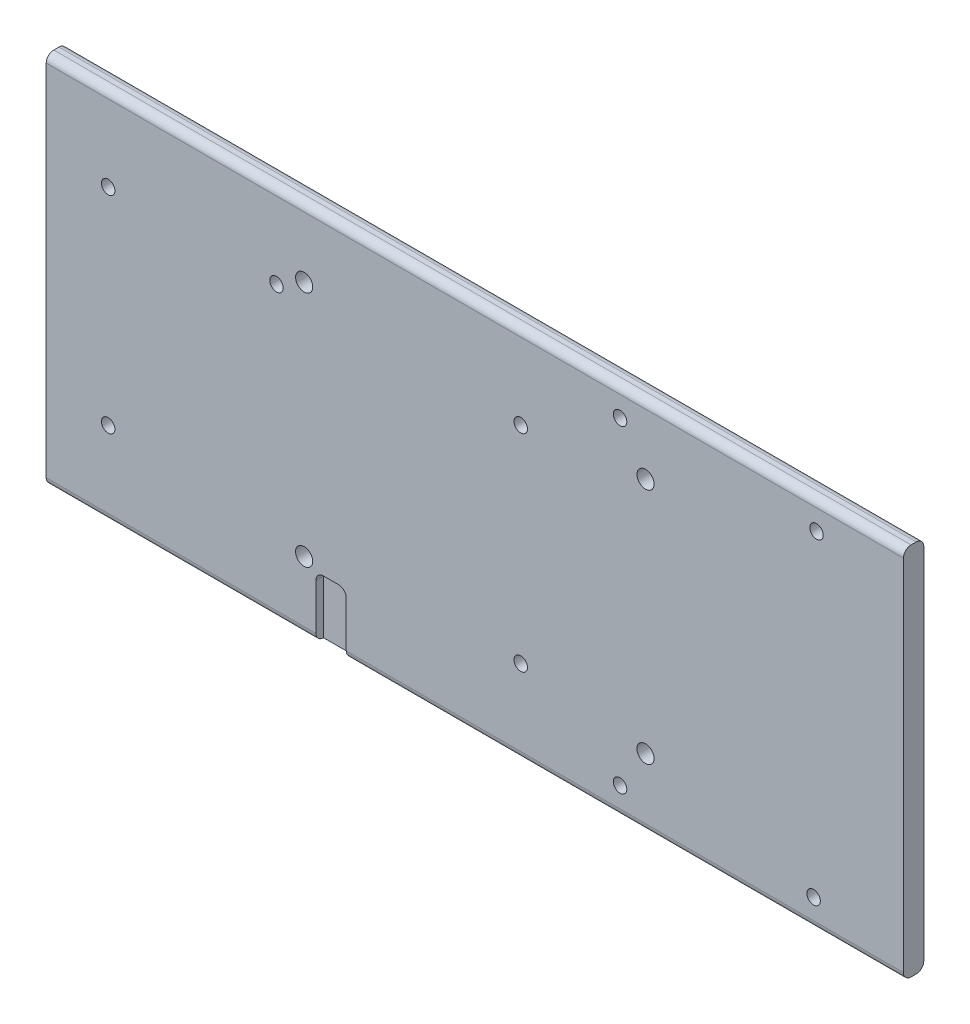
from build123d import *

# Parameters (mm, degrees)
SKETCH1_W          = 101
SKETCH1_H          = 37.32
EXTRUDE1_DEPTH     = 2.68
SKETCH5_R          = 1.1303
CUT_EXTRUDE3_DEPTH = 108.707775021
SKETCH10_W         = 113
SKETCH10_H         = 49.32
SKETCH10_W_2       = 101
SKETCH10_H_2       = 37.32
EXTRUDE2_DEPTH     = 2.68
SKETCH12_R         = 0.889
CUT_EXTRUDE4_DEPTH = 116.467765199
FILLET2_R          = 1
FILLET3_R          = 1
FILLET4_R          = 1
FILLET5_R          = 1
CUT_EXTRUDE5_DEPTH = 1


with BuildPart() as part:
    # Sketch1 → Extrude1 (new body)
    with BuildSketch(Plane.XY):
        with Locations((50.5, 18.66)):
            Rectangle(SKETCH1_W, SKETCH1_H)
    extrude(amount=EXTRUDE1_DEPTH)

    # Sketch5 → Cut-Extrude3 (cut, through all)
    with BuildSketch(Plane(origin=(0, 0, 0), x_dir=(-1, 0, 0), z_dir=(0, 0, -1))):
        with Locations((-28, 3)):
            Circle(SKETCH5_R)
        with Locations((-28, 34.32)):
            Circle(SKETCH5_R)
        with Locations((-73, 34.32)):
            Circle(SKETCH5_R)
        with Locations((-73, 3)):
            Circle(SKETCH5_R)
    extrude(amount=-CUT_EXTRUDE3_DEPTH, mode=Mode.SUBTRACT)

    # Sketch10 → Extrude2 (add)
    with BuildSketch(Plane.XY.offset(2.68)):
        with Locations((50.5, 18.66)):
            Rectangle(SKETCH10_W, SKETCH10_H)
        with Locations((50.5, 18.66)):
            Rectangle(SKETCH10_W_2, SKETCH10_H_2, mode=Mode.SUBTRACT)
    extrude(amount=-EXTRUDE2_DEPTH)

    # Sketch12 → Cut-Extrude4 (cut, through all)
    with BuildSketch(Plane(origin=(0, 0, 0), x_dir=(-1, 0, 0), z_dir=(0, 0, -1))):
        with Locations((-69.640955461, 39.635787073)):
            Circle(SKETCH12_R)
        with Locations((-2.16398911, 5.05)):
            Circle(SKETCH12_R)
        with Locations((-56.55, 5.05)):
            Circle(SKETCH12_R)
        with Locations((-56.55, 32.27)):
            Circle(SKETCH12_R)
        with Locations((-95.537468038, 39.635787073)):
            Circle(SKETCH12_R)
        with Locations((-2.16398911, 32.27)):
            Circle(SKETCH12_R)
        with Locations((-24.355, 32.27)):
            Circle(SKETCH12_R)
        with Locations((-95.154925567, -2.315787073)):
            Circle(SKETCH12_R)
        with Locations((-69.640955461, -2.315787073)):
            Circle(SKETCH12_R)
    extrude(amount=-CUT_EXTRUDE4_DEPTH, mode=Mode.SUBTRACT)

    # Fillet2
    fillet2_edges = [part.edges().sort_by_distance(p)[0] for p in [
        (50.5, 43.32, 2.68),
    ]]
    fillet(fillet2_edges, radius=FILLET2_R)

    # Fillet3
    fillet3_edges = [part.edges().sort_by_distance(p)[0] for p in [
        (50.5, -6, 2.68),
    ]]
    fillet(fillet3_edges, radius=FILLET3_R)

    # Fillet4
    fillet4_edges = [part.edges().sort_by_distance(p)[0] for p in [
        (50.5, -6, 0),
    ]]
    fillet(fillet4_edges, radius=FILLET4_R)

    # Fillet5
    fillet5_edges = [part.edges().sort_by_distance(p)[0] for p in [
        (50.5, 43.32, 0),
    ]]
    fillet(fillet5_edges, radius=FILLET5_R)

    # Sketch13 → Cut-Extrude5 (cut)
    with BuildSketch(Plane.XY.offset(2.68)):
        with BuildLine():
            Line((33.55, 1.05), (33.55, -2))
            Line((33.55, -2), (33.55, -5))
            Line((33.55, -5), (33.55, -6.526678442))
            Line((33.55, -6.526678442), (29.55, -6.526678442))
            Line((29.55, -6.526678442), (29.55, -5))
            Line((29.55, -5), (29.55, -2))
            Line((29.55, -2), (29.55, 1.05))
            ThreePointArc((29.55, 1.05), (29.842893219, 1.757106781), (30.55, 2.05))
            Line((30.55, 2.05), (32.55, 2.05))
            ThreePointArc((32.55, 2.05), (33.257106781, 1.757106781), (33.55, 1.05))
        make_face()
    extrude(amount=-CUT_EXTRUDE5_DEPTH, mode=Mode.SUBTRACT)


solid = part.part
